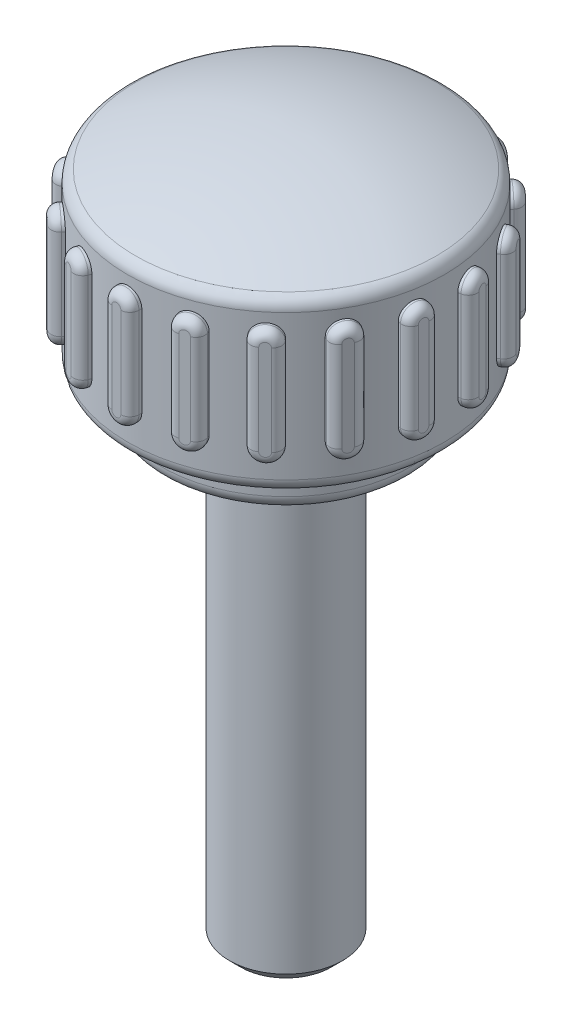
from build123d import *

# Parameters (mm, degrees)
EXTRUSION1_DEPTH                   = 7.5
CONG_1_R                           = 0.4
R_P_TITION_CIRCULAIRE1_COUNT       = 18
CONG_1_OF_R_P_TITION_CIRCULAIRE1_R = 0.4
CONG_2_R                           = 0.6
ESQUISSE3_R                        = 2.5
EXTRUSION2_DEPTH                   = 20
CHANFREIN1_SIZE                    = 0.5


with BuildPart() as part:
    # Esquisse1 → R_volution1 (revolve)
    with BuildSketch(Plane.XY, mode=Mode.PRIVATE) as r_volution1_sk:
        with BuildLine():
            Line((0, 0), (3.5, 0))
            Line((3.5, 0), (3.5, 0.3))
            Line((3.5, 0.3), (5.5, 0.3))
            Line((5.5, 0.3), (5.5, 2))
            Line((5.5, 2), (7, 2))
            Line((7, 2), (7, 9.38749457))
            ThreePointArc((7, 9.38749457), (3.591663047, 10.591663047), (0, 11))
            Line((0, 11), (0, 0))
        make_face()
    revolve(r_volution1_sk.sketch.rotate(Axis((0, 0, 0), (0, 1, 0)), 90), axis=Axis((0, 0, 0), (0, 1, 0)))

    # Esquisse2 → Extrusion1 (add)
    with BuildSketch(Plane.XY):
        with BuildLine():
            Line((0.6, 8), (0.6, 4))
            ThreePointArc((0.6, 4), (0, 3.4), (-0.6, 4))
            Line((-0.6, 4), (-0.6, 8))
            ThreePointArc((-0.6, 8), (0, 8.6), (0.6, 8))
        make_face()
    extrusion1 = extrude(amount=EXTRUSION1_DEPTH)

    # Cong_1
    cong_1_edges = [part.edges().sort_by_distance(p)[0] for p in [
        (0, 8.6, 7.5),
        (-0.6, 6, 7.5),
        (0, 3.4, 7.5),
        (0.6, 6, 7.5),
    ]]
    fillet(cong_1_edges, radius=CONG_1_R)

    # R_p_tition circulaire1: Extrusion1 ×18 about axis
    r_p_tition_circulaire1_axis = Axis((0, 0, 0), (0, 1, 0))
    for i in range(1, R_P_TITION_CIRCULAIRE1_COUNT):
        add(extrusion1.rotate(r_p_tition_circulaire1_axis, i * 360 / R_P_TITION_CIRCULAIRE1_COUNT))

    # Cong_1 of R_p_tition circulaire1
    cong_1_of_r_p_tition_circulaire1_edges = [part.edges().sort_by_distance(p)[0] for p in [
        (2.565151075, 8.6, 7.047694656),
        (2.001335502, 6, 7.252906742),
        (2.565151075, 3.4, 7.047694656),
        (3.128966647, 6, 6.84248257),
        (4.820907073, 8.6, 5.745333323),
        (4.361280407, 6, 6.131005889),
        (4.820907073, 3.4, 5.745333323),
        (5.280533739, 6, 5.359660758),
        (6.495190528, 8.6, 3.75),
        (6.195190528, 6, 4.269615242),
        (6.495190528, 3.4, 3.75),
        (6.795190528, 6, 3.230384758),
        (7.386058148, 8.6, 1.302361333),
        (7.281869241, 6, 1.893245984),
        (7.386058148, 3.4, 1.302361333),
        (7.490247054, 6, 0.711476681),
        (7.386058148, 8.6, -1.302361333),
        (7.490247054, 6, -0.711476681),
        (7.386058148, 3.4, -1.302361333),
        (7.281869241, 6, -1.893245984),
        (6.495190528, 8.6, -3.75),
        (6.795190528, 6, -3.230384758),
        (6.495190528, 3.4, -3.75),
        (6.195190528, 6, -4.269615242),
        (4.820907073, 8.6, -5.745333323),
        (5.280533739, 6, -5.359660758),
        (4.820907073, 3.4, -5.745333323),
        (4.361280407, 6, -6.131005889),
        (2.565151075, 8.6, -7.047694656),
        (3.128966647, 6, -6.84248257),
        (2.565151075, 3.4, -7.047694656),
        (2.001335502, 6, -7.252906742),
        (0, 8.6, -7.5),
        (0.6, 6, -7.5),
        (0, 3.4, -7.5),
        (-0.6, 6, -7.5),
        (-2.565151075, 8.6, -7.047694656),
        (-2.001335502, 6, -7.252906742),
        (-2.565151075, 3.4, -7.047694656),
        (-3.128966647, 6, -6.84248257),
        (-4.820907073, 8.6, -5.745333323),
        (-4.361280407, 6, -6.131005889),
        (-4.820907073, 3.4, -5.745333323),
        (-5.280533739, 6, -5.359660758),
        (-6.495190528, 8.6, -3.75),
        (-6.195190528, 6, -4.269615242),
        (-6.495190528, 3.4, -3.75),
        (-6.795190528, 6, -3.230384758),
        (-7.386058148, 8.6, -1.302361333),
        (-7.281869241, 6, -1.893245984),
        (-7.386058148, 3.4, -1.302361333),
        (-7.490247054, 6, -0.711476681),
        (-7.386058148, 8.6, 1.302361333),
        (-7.490247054, 6, 0.711476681),
        (-7.386058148, 3.4, 1.302361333),
        (-7.281869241, 6, 1.893245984),
        (-6.495190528, 8.6, 3.75),
        (-6.795190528, 6, 3.230384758),
        (-6.495190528, 3.4, 3.75),
        (-6.195190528, 6, 4.269615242),
        (-4.820907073, 8.6, 5.745333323),
        (-5.280533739, 6, 5.359660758),
        (-4.820907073, 3.4, 5.745333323),
        (-4.361280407, 6, 6.131005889),
        (-2.565151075, 8.6, 7.047694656),
        (-3.128966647, 6, 6.84248257),
        (-2.565151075, 3.4, 7.047694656),
        (-2.001335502, 6, 7.252906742),
    ]]
    fillet(cong_1_of_r_p_tition_circulaire1_edges, radius=CONG_1_OF_R_P_TITION_CIRCULAIRE1_R)

    # Cong_2
    cong_2_edges = [part.edges().sort_by_distance(p)[0] for p in [
        (0, 9.38749457, 7),
        (0, 2, 7),
        (0, 0.3, 5.5),
    ]]
    fillet(cong_2_edges, radius=CONG_2_R)

    # Esquisse3 → Extrusion2 (add)
    with BuildSketch(Plane.XZ):
        with Locations(Location((0, 0, 0), (0, 0, 270))):
            Circle(ESQUISSE3_R)
    extrude(amount=EXTRUSION2_DEPTH)

    # Chanfrein1
    chanfrein1_edges = [part.edges().sort_by_distance(p)[0] for p in [
        (0, -20, 2.5),
    ]]
    chamfer(chanfrein1_edges, length=CHANFREIN1_SIZE)


solid = part.part
